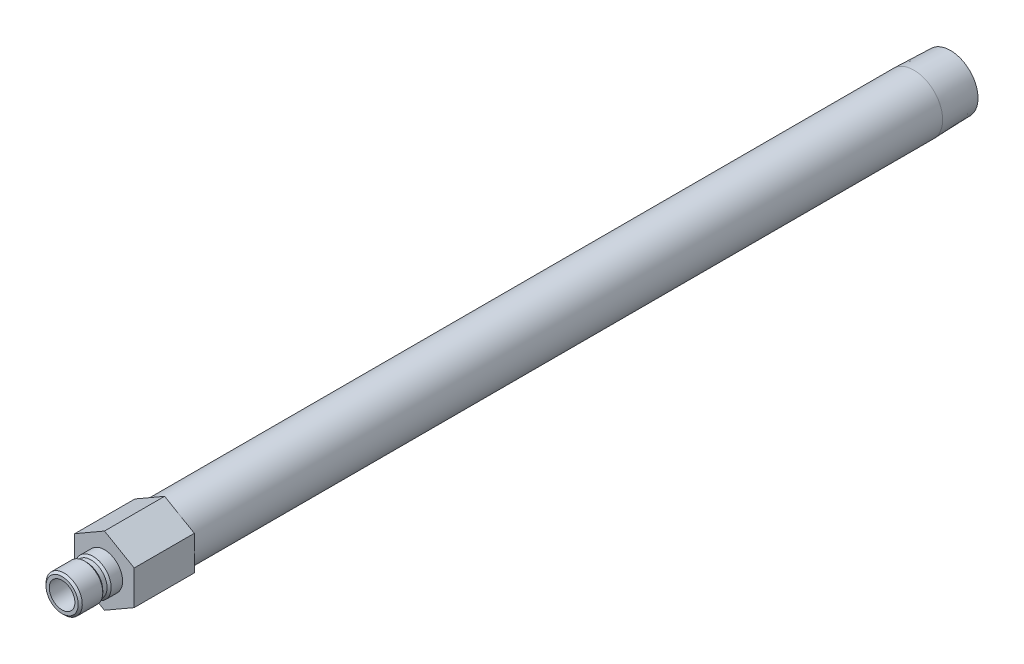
ISO-10303-21;
HEADER;
FILE_DESCRIPTION(('STEP AP214'),'2;1');
FILE_NAME('part.step','',(''),(''),'','','');
FILE_SCHEMA(('AUTOMOTIVE_DESIGN { 1 0 10303 214 1 1 1 1 }'));
ENDSEC;
DATA;
#1=APPLICATION_CONTEXT('core data for automotive mechanical design processes');
#2=APPLICATION_PROTOCOL_DEFINITION('international standard','automotive_design',2000,#1);
#3=PRODUCT_CONTEXT('',#1,'mechanical');
#4=PRODUCT('Part','Part','',(#3));
#5=PRODUCT_RELATED_PRODUCT_CATEGORY('part','',(#4));
#6=PRODUCT_DEFINITION_FORMATION('','',#4);
#7=PRODUCT_DEFINITION_CONTEXT('part definition',#1,'design');
#8=PRODUCT_DEFINITION('design','',#6,#7);
#9=PRODUCT_DEFINITION_SHAPE('','',#8);
#10=(LENGTH_UNIT() NAMED_UNIT(*) SI_UNIT(.MILLI.,.METRE.));
#11=(NAMED_UNIT(*) PLANE_ANGLE_UNIT() SI_UNIT($,.RADIAN.));
#12=(NAMED_UNIT(*) SI_UNIT($,.STERADIAN.) SOLID_ANGLE_UNIT());
#13=UNCERTAINTY_MEASURE_WITH_UNIT(LENGTH_MEASURE(1.E-05),#10,'distance_accuracy_value','');
#14=(GEOMETRIC_REPRESENTATION_CONTEXT(3) GLOBAL_UNCERTAINTY_ASSIGNED_CONTEXT((#13)) GLOBAL_UNIT_ASSIGNED_CONTEXT((#10,
#11,#12)) REPRESENTATION_CONTEXT('',''));
#15=CARTESIAN_POINT('',(0.,0.,0.));
#16=DIRECTION('',(0.,0.,1.));
#17=DIRECTION('',(1.,0.,0.));
#18=AXIS2_PLACEMENT_3D('',#15,#16,#17);
#19=CARTESIAN_POINT('',(0.,0.,0.));
#20=DIRECTION('',(0.,0.,-1.));
#21=DIRECTION('',(0.,1.,0.));
#22=AXIS2_PLACEMENT_3D('',#19,#20,#21);
#23=CYLINDRICAL_SURFACE('',#22,10.668);
#24=CARTESIAN_POINT('',(0.,0.,-300.8884));
#25=DIRECTION('',(0.,0.,-1.));
#26=DIRECTION('',(0.,1.,0.));
#27=AXIS2_PLACEMENT_3D('',#24,#25,#26);
#28=CIRCLE('',#27,10.6679999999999);
#29=CARTESIAN_POINT('',(0.,10.668,-300.8884));
#30=VERTEX_POINT('',#29);
#31=EDGE_CURVE('E168',#30,#30,#28,.T.);
#32=ORIENTED_EDGE('',*,*,#31,.F.);
#33=EDGE_LOOP('',(#32));
#34=FACE_BOUND('',#33,.T.);
#35=CARTESIAN_POINT('',(0.,0.,-22.352));
#36=DIRECTION('',(0.,0.,1.));
#37=DIRECTION('',(1.,0.,0.));
#38=AXIS2_PLACEMENT_3D('',#35,#36,#37);
#39=CIRCLE('',#38,10.668);
#40=CARTESIAN_POINT('',(10.668,0.,-22.352));
#41=VERTEX_POINT('',#40);
#42=EDGE_CURVE('E37',#41,#41,#39,.F.);
#43=ORIENTED_EDGE('',*,*,#42,.T.);
#44=EDGE_LOOP('',(#43));
#45=FACE_BOUND('',#44,.T.);
#46=ADVANCED_FACE('F33',(#34,#45),#23,.T.);
#47=CARTESIAN_POINT('',(0.,0.,0.));
#48=DIRECTION('',(0.,0.,-1.));
#49=DIRECTION('',(0.,1.,0.));
#50=AXIS2_PLACEMENT_3D('',#47,#48,#49);
#51=CYLINDRICAL_SURFACE('',#50,4.76249999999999);
#52=CARTESIAN_POINT('',(0.,0.,15.748));
#53=DIRECTION('',(0.,0.,-1.));
#54=DIRECTION('',(0.,1.,0.));
#55=AXIS2_PLACEMENT_3D('',#52,#53,#54);
#56=CIRCLE('',#55,4.7625);
#57=CARTESIAN_POINT('',(0.,4.7625,15.748));
#58=VERTEX_POINT('',#57);
#59=EDGE_CURVE('E144',#58,#58,#56,.T.);
#60=ORIENTED_EDGE('',*,*,#59,.F.);
#61=EDGE_LOOP('',(#60));
#62=FACE_BOUND('',#61,.T.);
#63=CARTESIAN_POINT('',(0.,0.,-22.352));
#64=DIRECTION('',(0.,0.,-1.));
#65=DIRECTION('',(0.,1.,0.));
#66=AXIS2_PLACEMENT_3D('',#63,#64,#65);
#67=CIRCLE('',#66,4.76249999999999);
#68=CARTESIAN_POINT('',(0.,4.7625,-22.352));
#69=VERTEX_POINT('',#68);
#70=EDGE_CURVE('E11',#69,#69,#67,.T.);
#71=ORIENTED_EDGE('',*,*,#70,.T.);
#72=EDGE_LOOP('',(#71));
#73=FACE_BOUND('',#72,.T.);
#74=ADVANCED_FACE('F35',(#62,#73),#51,.F.);
#75=CARTESIAN_POINT('',(0.,4.7625,-22.352));
#76=DIRECTION('',(0.,0.,-1.));
#77=DIRECTION('',(0.,1.,0.));
#78=AXIS2_PLACEMENT_3D('',#75,#76,#77);
#79=PLANE('',#78);
#80=CARTESIAN_POINT('',(0.,0.,-22.352));
#81=DIRECTION('',(0.,0.,-1.));
#82=DIRECTION('',(0.,1.,0.));
#83=AXIS2_PLACEMENT_3D('',#80,#81,#82);
#84=CIRCLE('',#83,7.89939999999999);
#85=CARTESIAN_POINT('',(0.,7.8994,-22.352));
#86=VERTEX_POINT('',#85);
#87=EDGE_CURVE('E43',#86,#86,#84,.T.);
#88=ORIENTED_EDGE('',*,*,#87,.T.);
#89=EDGE_LOOP('',(#88));
#90=FACE_BOUND('',#89,.T.);
#91=ORIENTED_EDGE('',*,*,#70,.F.);
#92=EDGE_LOOP('',(#91));
#93=FACE_BOUND('',#92,.T.);
#94=ADVANCED_FACE('F180',(#90,#93),#79,.T.);
#95=CARTESIAN_POINT('',(0.,0.,0.));
#96=DIRECTION('',(0.,0.,-1.));
#97=DIRECTION('',(0.,1.,0.));
#98=AXIS2_PLACEMENT_3D('',#95,#96,#97);
#99=CYLINDRICAL_SURFACE('',#98,7.89939999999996);
#100=CARTESIAN_POINT('',(0.,0.,-314.452));
#101=DIRECTION('',(0.,0.,-1.));
#102=DIRECTION('',(0.,1.,0.));
#103=AXIS2_PLACEMENT_3D('',#100,#101,#102);
#104=CIRCLE('',#103,7.89939999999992);
#105=CARTESIAN_POINT('',(0.,7.8994,-314.452));
#106=VERTEX_POINT('',#105);
#107=EDGE_CURVE('E174',#106,#106,#104,.T.);
#108=ORIENTED_EDGE('',*,*,#107,.T.);
#109=EDGE_LOOP('',(#108));
#110=FACE_BOUND('',#109,.T.);
#111=ORIENTED_EDGE('',*,*,#87,.F.);
#112=EDGE_LOOP('',(#111));
#113=FACE_BOUND('',#112,.T.);
#114=ADVANCED_FACE('F183',(#110,#113),#99,.F.);
#115=CARTESIAN_POINT('',(0.,10.244140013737,-314.452));
#116=DIRECTION('',(0.,0.,-1.));
#117=DIRECTION('',(0.,1.,0.));
#118=AXIS2_PLACEMENT_3D('',#115,#116,#117);
#119=PLANE('',#118);
#120=CARTESIAN_POINT('',(0.,0.,-314.452));
#121=DIRECTION('',(0.,0.,-1.));
#122=DIRECTION('',(0.,1.,0.));
#123=AXIS2_PLACEMENT_3D('',#120,#121,#122);
#124=CIRCLE('',#123,10.2441400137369);
#125=CARTESIAN_POINT('',(0.,10.244140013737,-314.452));
#126=VERTEX_POINT('',#125);
#127=EDGE_CURVE('E171',#126,#126,#124,.T.);
#128=ORIENTED_EDGE('',*,*,#127,.T.);
#129=EDGE_LOOP('',(#128));
#130=FACE_BOUND('',#129,.T.);
#131=ORIENTED_EDGE('',*,*,#107,.F.);
#132=EDGE_LOOP('',(#131));
#133=FACE_BOUND('',#132,.T.);
#134=ADVANCED_FACE('F185',(#130,#133),#119,.T.);
#135=CARTESIAN_POINT('',(0.,0.,-314.452));
#136=DIRECTION('',(0.,0.,1.));
#137=DIRECTION('',(0.,-1.,0.));
#138=AXIS2_PLACEMENT_3D('',#135,#136,#137);
#139=CONICAL_SURFACE('',#138,10.2441400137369,0.0312396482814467);
#140=ORIENTED_EDGE('',*,*,#31,.T.);
#141=EDGE_LOOP('',(#140));
#142=FACE_BOUND('',#141,.T.);
#143=ORIENTED_EDGE('',*,*,#127,.F.);
#144=EDGE_LOOP('',(#143));
#145=FACE_BOUND('',#144,.T.);
#146=ADVANCED_FACE('F192',(#142,#145),#139,.T.);
#147=CARTESIAN_POINT('',(0.,6.7437,0.));
#148=DIRECTION('',(0.,0.,1.));
#149=DIRECTION('',(0.,-1.,0.));
#150=AXIS2_PLACEMENT_3D('',#147,#148,#149);
#151=PLANE('',#150);
#152=CARTESIAN_POINT('',(0.,0.,0.));
#153=DIRECTION('',(0.,0.,-1.));
#154=DIRECTION('',(0.,1.,0.));
#155=AXIS2_PLACEMENT_3D('',#152,#153,#154);
#156=CIRCLE('',#155,6.7437);
#157=CARTESIAN_POINT('',(0.,6.7437,0.));
#158=VERTEX_POINT('',#157);
#159=EDGE_CURVE('E165',#158,#158,#156,.T.);
#160=ORIENTED_EDGE('',*,*,#159,.T.);
#161=EDGE_LOOP('',(#160));
#162=FACE_BOUND('',#161,.T.);
#163=DIRECTION('',(-0.866025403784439,-0.5,0.));
#164=VECTOR('',#163,1.);
#165=CARTESIAN_POINT('',(0.,12.7582862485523,0.));
#166=LINE('',#165,#164);
#167=CARTESIAN_POINT('',(0.,12.7582862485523,0.));
#168=VERTEX_POINT('',#167);
#169=CARTESIAN_POINT('',(-11.049,6.37914312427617,0.));
#170=VERTEX_POINT('',#169);
#171=EDGE_CURVE('E122',#168,#170,#166,.T.);
#172=ORIENTED_EDGE('',*,*,#171,.T.);
#173=DIRECTION('',(0.,-1.,0.));
#174=VECTOR('',#173,1.);
#175=CARTESIAN_POINT('',(-11.049,6.37914312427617,0.));
#176=LINE('',#175,#174);
#177=CARTESIAN_POINT('',(-11.049,-6.37914312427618,0.));
#178=VERTEX_POINT('',#177);
#179=EDGE_CURVE('E125',#170,#178,#176,.T.);
#180=ORIENTED_EDGE('',*,*,#179,.T.);
#181=DIRECTION('',(0.866025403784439,-0.5,0.));
#182=VECTOR('',#181,1.);
#183=CARTESIAN_POINT('',(-11.049,-6.37914312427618,0.));
#184=LINE('',#183,#182);
#185=CARTESIAN_POINT('',(0.,-12.7582862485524,0.));
#186=VERTEX_POINT('',#185);
#187=EDGE_CURVE('E128',#178,#186,#184,.T.);
#188=ORIENTED_EDGE('',*,*,#187,.T.);
#189=DIRECTION('',(0.866025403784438,0.5,0.));
#190=VECTOR('',#189,1.);
#191=CARTESIAN_POINT('',(0.,-12.7582862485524,0.));
#192=LINE('',#191,#190);
#193=CARTESIAN_POINT('',(11.049,-6.37914312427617,0.));
#194=VERTEX_POINT('',#193);
#195=EDGE_CURVE('E131',#186,#194,#192,.T.);
#196=ORIENTED_EDGE('',*,*,#195,.T.);
#197=DIRECTION('',(0.,1.,0.));
#198=VECTOR('',#197,1.);
#199=CARTESIAN_POINT('',(11.049,-6.37914312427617,0.));
#200=LINE('',#199,#198);
#201=CARTESIAN_POINT('',(11.049,6.37914312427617,0.));
#202=VERTEX_POINT('',#201);
#203=EDGE_CURVE('E99',#194,#202,#200,.T.);
#204=ORIENTED_EDGE('',*,*,#203,.T.);
#205=DIRECTION('',(-0.866025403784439,0.5,0.));
#206=VECTOR('',#205,1.);
#207=CARTESIAN_POINT('',(11.049,6.37914312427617,0.));
#208=LINE('',#207,#206);
#209=EDGE_CURVE('E134',#202,#168,#208,.T.);
#210=ORIENTED_EDGE('',*,*,#209,.T.);
#211=EDGE_LOOP('',(#172,#180,#188,#196,#204,#210));
#212=FACE_BOUND('',#211,.T.);
#213=ADVANCED_FACE('F206',(#162,#212),#151,.T.);
#214=CARTESIAN_POINT('',(0.,0.,0.));
#215=DIRECTION('',(0.,0.,-1.));
#216=DIRECTION('',(0.,1.,0.));
#217=AXIS2_PLACEMENT_3D('',#214,#215,#216);
#218=CYLINDRICAL_SURFACE('',#217,6.7437);
#219=CARTESIAN_POINT('',(0.,0.,4.25449999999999));
#220=DIRECTION('',(0.,0.,-1.));
#221=DIRECTION('',(0.,1.,0.));
#222=AXIS2_PLACEMENT_3D('',#219,#220,#221);
#223=CIRCLE('',#222,6.7437);
#224=CARTESIAN_POINT('',(0.,6.7437,4.25449999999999));
#225=VERTEX_POINT('',#224);
#226=EDGE_CURVE('E162',#225,#225,#223,.T.);
#227=ORIENTED_EDGE('',*,*,#226,.T.);
#228=EDGE_LOOP('',(#227));
#229=FACE_BOUND('',#228,.T.);
#230=ORIENTED_EDGE('',*,*,#159,.F.);
#231=EDGE_LOOP('',(#230));
#232=FACE_BOUND('',#231,.T.);
#233=ADVANCED_FACE('F213',(#229,#232),#218,.T.);
#234=CARTESIAN_POINT('',(0.,0.,4.25449999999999));
#235=DIRECTION('',(0.,0.,-1.));
#236=DIRECTION('',(0.,1.,0.));
#237=AXIS2_PLACEMENT_3D('',#234,#235,#236);
#238=CONICAL_SURFACE('',#237,6.7437,0.785398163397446);
#239=CARTESIAN_POINT('',(0.,0.,5.0165));
#240=DIRECTION('',(0.,0.,-1.));
#241=DIRECTION('',(0.,1.,0.));
#242=AXIS2_PLACEMENT_3D('',#239,#240,#241);
#243=CIRCLE('',#242,5.9817);
#244=CARTESIAN_POINT('',(0.,5.9817,5.0165));
#245=VERTEX_POINT('',#244);
#246=EDGE_CURVE('E159',#245,#245,#243,.T.);
#247=ORIENTED_EDGE('',*,*,#246,.T.);
#248=EDGE_LOOP('',(#247));
#249=FACE_BOUND('',#248,.T.);
#250=ORIENTED_EDGE('',*,*,#226,.F.);
#251=EDGE_LOOP('',(#250));
#252=FACE_BOUND('',#251,.T.);
#253=ADVANCED_FACE('F222',(#249,#252),#238,.T.);
#254=CARTESIAN_POINT('',(0.,0.,0.));
#255=DIRECTION('',(0.,0.,-1.));
#256=DIRECTION('',(0.,1.,0.));
#257=AXIS2_PLACEMENT_3D('',#254,#255,#256);
#258=CYLINDRICAL_SURFACE('',#257,5.9817);
#259=CARTESIAN_POINT('',(0.,0.,6.604));
#260=DIRECTION('',(0.,0.,-1.));
#261=DIRECTION('',(0.,1.,0.));
#262=AXIS2_PLACEMENT_3D('',#259,#260,#261);
#263=CIRCLE('',#262,5.9817);
#264=CARTESIAN_POINT('',(0.,5.9817,6.604));
#265=VERTEX_POINT('',#264);
#266=EDGE_CURVE('E156',#265,#265,#263,.T.);
#267=ORIENTED_EDGE('',*,*,#266,.T.);
#268=EDGE_LOOP('',(#267));
#269=FACE_BOUND('',#268,.T.);
#270=ORIENTED_EDGE('',*,*,#246,.F.);
#271=EDGE_LOOP('',(#270));
#272=FACE_BOUND('',#271,.T.);
#273=ADVANCED_FACE('F263',(#269,#272),#258,.T.);
#274=CARTESIAN_POINT('',(0.,0.,6.604));
#275=DIRECTION('',(0.,0.,1.));
#276=DIRECTION('',(0.,-1.,0.));
#277=AXIS2_PLACEMENT_3D('',#274,#275,#276);
#278=CONICAL_SURFACE('',#277,5.9817,0.785398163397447);
#279=CARTESIAN_POINT('',(0.,0.,7.366));
#280=DIRECTION('',(0.,0.,-1.));
#281=DIRECTION('',(0.,1.,0.));
#282=AXIS2_PLACEMENT_3D('',#279,#280,#281);
#283=CIRCLE('',#282,6.7437);
#284=CARTESIAN_POINT('',(0.,6.7437,7.366));
#285=VERTEX_POINT('',#284);
#286=EDGE_CURVE('E153',#285,#285,#283,.T.);
#287=ORIENTED_EDGE('',*,*,#286,.T.);
#288=EDGE_LOOP('',(#287));
#289=FACE_BOUND('',#288,.T.);
#290=ORIENTED_EDGE('',*,*,#266,.F.);
#291=EDGE_LOOP('',(#290));
#292=FACE_BOUND('',#291,.T.);
#293=ADVANCED_FACE('F259',(#289,#292),#278,.T.);
#294=CARTESIAN_POINT('',(0.,0.,0.));
#295=DIRECTION('',(0.,0.,-1.));
#296=DIRECTION('',(0.,1.,0.));
#297=AXIS2_PLACEMENT_3D('',#294,#295,#296);
#298=CYLINDRICAL_SURFACE('',#297,6.7437);
#299=CARTESIAN_POINT('',(0.,0.,14.986));
#300=DIRECTION('',(0.,0.,-1.));
#301=DIRECTION('',(0.,1.,0.));
#302=AXIS2_PLACEMENT_3D('',#299,#300,#301);
#303=CIRCLE('',#302,6.7437);
#304=CARTESIAN_POINT('',(0.,6.7437,14.986));
#305=VERTEX_POINT('',#304);
#306=EDGE_CURVE('E150',#305,#305,#303,.T.);
#307=ORIENTED_EDGE('',*,*,#306,.T.);
#308=EDGE_LOOP('',(#307));
#309=FACE_BOUND('',#308,.T.);
#310=ORIENTED_EDGE('',*,*,#286,.F.);
#311=EDGE_LOOP('',(#310));
#312=FACE_BOUND('',#311,.T.);
#313=ADVANCED_FACE('F255',(#309,#312),#298,.T.);
#314=CARTESIAN_POINT('',(0.,0.,14.986));
#315=DIRECTION('',(0.,0.,-1.));
#316=DIRECTION('',(0.,1.,0.));
#317=AXIS2_PLACEMENT_3D('',#314,#315,#316);
#318=CONICAL_SURFACE('',#317,6.7437,0.785398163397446);
#319=CARTESIAN_POINT('',(0.,0.,15.748));
#320=DIRECTION('',(0.,0.,-1.));
#321=DIRECTION('',(0.,1.,0.));
#322=AXIS2_PLACEMENT_3D('',#319,#320,#321);
#323=CIRCLE('',#322,5.9817);
#324=CARTESIAN_POINT('',(0.,5.9817,15.748));
#325=VERTEX_POINT('',#324);
#326=EDGE_CURVE('E147',#325,#325,#323,.T.);
#327=ORIENTED_EDGE('',*,*,#326,.T.);
#328=EDGE_LOOP('',(#327));
#329=FACE_BOUND('',#328,.T.);
#330=ORIENTED_EDGE('',*,*,#306,.F.);
#331=EDGE_LOOP('',(#330));
#332=FACE_BOUND('',#331,.T.);
#333=ADVANCED_FACE('F251',(#329,#332),#318,.T.);
#334=CARTESIAN_POINT('',(0.,4.7625,15.748));
#335=DIRECTION('',(0.,0.,1.));
#336=DIRECTION('',(0.,-1.,0.));
#337=AXIS2_PLACEMENT_3D('',#334,#335,#336);
#338=PLANE('',#337);
#339=ORIENTED_EDGE('',*,*,#59,.T.);
#340=EDGE_LOOP('',(#339));
#341=FACE_BOUND('',#340,.T.);
#342=ORIENTED_EDGE('',*,*,#326,.F.);
#343=EDGE_LOOP('',(#342));
#344=FACE_BOUND('',#343,.T.);
#345=ADVANCED_FACE('F239',(#341,#344),#338,.T.);
#346=CARTESIAN_POINT('',(0.,12.7582862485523,-22.352));
#347=DIRECTION('',(-0.5,0.866025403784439,0.));
#348=DIRECTION('',(-0.866025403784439,-0.5,0.));
#349=AXIS2_PLACEMENT_3D('',#346,#347,#348);
#350=PLANE('',#349);
#351=ORIENTED_EDGE('',*,*,#171,.F.);
#352=DIRECTION('',(0.,0.,1.));
#353=VECTOR('',#352,1.);
#354=CARTESIAN_POINT('',(0.,12.7582862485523,-22.352));
#355=LINE('',#354,#353);
#356=CARTESIAN_POINT('',(0.,12.7582862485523,-22.352));
#357=VERTEX_POINT('',#356);
#358=EDGE_CURVE('E51',#357,#168,#355,.T.);
#359=ORIENTED_EDGE('',*,*,#358,.F.);
#360=DIRECTION('',(-0.866025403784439,-0.5,0.));
#361=VECTOR('',#360,1.);
#362=CARTESIAN_POINT('',(0.,12.7582862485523,-22.352));
#363=LINE('',#362,#361);
#364=CARTESIAN_POINT('',(-11.049,6.37914312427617,-22.352));
#365=VERTEX_POINT('',#364);
#366=EDGE_CURVE('E137',#357,#365,#363,.T.);
#367=ORIENTED_EDGE('',*,*,#366,.T.);
#368=DIRECTION('',(0.,0.,1.));
#369=VECTOR('',#368,1.);
#370=CARTESIAN_POINT('',(-11.049,6.37914312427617,-22.352));
#371=LINE('',#370,#369);
#372=EDGE_CURVE('E86',#365,#170,#371,.T.);
#373=ORIENTED_EDGE('',*,*,#372,.T.);
#374=EDGE_LOOP('',(#351,#359,#367,#373));
#375=FACE_BOUND('',#374,.T.);
#376=ADVANCED_FACE('F226',(#375),#350,.T.);
#377=CARTESIAN_POINT('',(11.049,6.37914312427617,-22.352));
#378=DIRECTION('',(0.5,0.866025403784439,0.));
#379=DIRECTION('',(-0.866025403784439,0.5,0.));
#380=AXIS2_PLACEMENT_3D('',#377,#378,#379);
#381=PLANE('',#380);
#382=ORIENTED_EDGE('',*,*,#209,.F.);
#383=DIRECTION('',(0.,0.,1.));
#384=VECTOR('',#383,1.);
#385=CARTESIAN_POINT('',(11.049,6.37914312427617,-22.352));
#386=LINE('',#385,#384);
#387=CARTESIAN_POINT('',(11.049,6.37914312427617,-22.352));
#388=VERTEX_POINT('',#387);
#389=EDGE_CURVE('E74',#388,#202,#386,.T.);
#390=ORIENTED_EDGE('',*,*,#389,.F.);
#391=DIRECTION('',(-0.866025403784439,0.5,0.));
#392=VECTOR('',#391,1.);
#393=CARTESIAN_POINT('',(11.049,6.37914312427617,-22.352));
#394=LINE('',#393,#392);
#395=EDGE_CURVE('E112',#388,#357,#394,.T.);
#396=ORIENTED_EDGE('',*,*,#395,.T.);
#397=ORIENTED_EDGE('',*,*,#358,.T.);
#398=EDGE_LOOP('',(#382,#390,#396,#397));
#399=FACE_BOUND('',#398,.T.);
#400=ADVANCED_FACE('F231',(#399),#381,.T.);
#401=CARTESIAN_POINT('',(11.049,-6.37914312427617,-22.352));
#402=DIRECTION('',(1.,0.,0.));
#403=DIRECTION('',(0.,0.,-1.));
#404=AXIS2_PLACEMENT_3D('',#401,#402,#403);
#405=PLANE('',#404);
#406=ORIENTED_EDGE('',*,*,#203,.F.);
#407=DIRECTION('',(0.,0.,1.));
#408=VECTOR('',#407,1.);
#409=CARTESIAN_POINT('',(11.049,-6.37914312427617,-22.352));
#410=LINE('',#409,#408);
#411=CARTESIAN_POINT('',(11.049,-6.37914312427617,-22.352));
#412=VERTEX_POINT('',#411);
#413=EDGE_CURVE('E94',#412,#194,#410,.T.);
#414=ORIENTED_EDGE('',*,*,#413,.F.);
#415=DIRECTION('',(0.,1.,0.));
#416=VECTOR('',#415,1.);
#417=CARTESIAN_POINT('',(11.049,-6.37914312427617,-22.352));
#418=LINE('',#417,#416);
#419=EDGE_CURVE('E97',#412,#388,#418,.T.);
#420=ORIENTED_EDGE('',*,*,#419,.T.);
#421=ORIENTED_EDGE('',*,*,#389,.T.);
#422=EDGE_LOOP('',(#406,#414,#420,#421));
#423=FACE_BOUND('',#422,.T.);
#424=ADVANCED_FACE('F96',(#423),#405,.T.);
#425=CARTESIAN_POINT('',(0.,-12.7582862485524,-22.352));
#426=DIRECTION('',(0.5,-0.866025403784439,0.));
#427=DIRECTION('',(0.866025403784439,0.5,0.));
#428=AXIS2_PLACEMENT_3D('',#425,#426,#427);
#429=PLANE('',#428);
#430=ORIENTED_EDGE('',*,*,#195,.F.);
#431=DIRECTION('',(0.,0.,1.));
#432=VECTOR('',#431,1.);
#433=CARTESIAN_POINT('',(0.,-12.7582862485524,-22.352));
#434=LINE('',#433,#432);
#435=CARTESIAN_POINT('',(0.,-12.7582862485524,-22.352));
#436=VERTEX_POINT('',#435);
#437=EDGE_CURVE('E104',#436,#186,#434,.T.);
#438=ORIENTED_EDGE('',*,*,#437,.F.);
#439=DIRECTION('',(0.866025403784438,0.5,0.));
#440=VECTOR('',#439,1.);
#441=CARTESIAN_POINT('',(0.,-12.7582862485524,-22.352));
#442=LINE('',#441,#440);
#443=EDGE_CURVE('E110',#436,#412,#442,.T.);
#444=ORIENTED_EDGE('',*,*,#443,.T.);
#445=ORIENTED_EDGE('',*,*,#413,.T.);
#446=EDGE_LOOP('',(#430,#438,#444,#445));
#447=FACE_BOUND('',#446,.T.);
#448=ADVANCED_FACE('F114',(#447),#429,.T.);
#449=CARTESIAN_POINT('',(-11.049,-6.37914312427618,-22.352));
#450=DIRECTION('',(-0.5,-0.866025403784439,0.));
#451=DIRECTION('',(0.866025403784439,-0.5,0.));
#452=AXIS2_PLACEMENT_3D('',#449,#450,#451);
#453=PLANE('',#452);
#454=ORIENTED_EDGE('',*,*,#187,.F.);
#455=DIRECTION('',(0.,0.,1.));
#456=VECTOR('',#455,1.);
#457=CARTESIAN_POINT('',(-11.049,-6.37914312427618,-22.352));
#458=LINE('',#457,#456);
#459=CARTESIAN_POINT('',(-11.049,-6.37914312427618,-22.352));
#460=VERTEX_POINT('',#459);
#461=EDGE_CURVE('E141',#460,#178,#458,.T.);
#462=ORIENTED_EDGE('',*,*,#461,.F.);
#463=DIRECTION('',(0.866025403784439,-0.5,0.));
#464=VECTOR('',#463,1.);
#465=CARTESIAN_POINT('',(-11.049,-6.37914312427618,-22.352));
#466=LINE('',#465,#464);
#467=EDGE_CURVE('E115',#460,#436,#466,.T.);
#468=ORIENTED_EDGE('',*,*,#467,.T.);
#469=ORIENTED_EDGE('',*,*,#437,.T.);
#470=EDGE_LOOP('',(#454,#462,#468,#469));
#471=FACE_BOUND('',#470,.T.);
#472=ADVANCED_FACE('F230',(#471),#453,.T.);
#473=CARTESIAN_POINT('',(-11.049,6.37914312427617,-22.352));
#474=DIRECTION('',(-1.,0.,0.));
#475=DIRECTION('',(0.,0.,1.));
#476=AXIS2_PLACEMENT_3D('',#473,#474,#475);
#477=PLANE('',#476);
#478=ORIENTED_EDGE('',*,*,#179,.F.);
#479=ORIENTED_EDGE('',*,*,#372,.F.);
#480=DIRECTION('',(0.,-1.,0.));
#481=VECTOR('',#480,1.);
#482=CARTESIAN_POINT('',(-11.049,6.37914312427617,-22.352));
#483=LINE('',#482,#481);
#484=EDGE_CURVE('E117',#365,#460,#483,.T.);
#485=ORIENTED_EDGE('',*,*,#484,.T.);
#486=ORIENTED_EDGE('',*,*,#461,.T.);
#487=EDGE_LOOP('',(#478,#479,#485,#486));
#488=FACE_BOUND('',#487,.T.);
#489=ADVANCED_FACE('F227',(#488),#477,.T.);
#490=CARTESIAN_POINT('',(-11.049,6.37914312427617,-22.352));
#491=DIRECTION('',(0.,0.,1.));
#492=DIRECTION('',(1.,0.,0.));
#493=AXIS2_PLACEMENT_3D('',#490,#491,#492);
#494=PLANE('',#493);
#495=ORIENTED_EDGE('',*,*,#42,.F.);
#496=EDGE_LOOP('',(#495));
#497=FACE_BOUND('',#496,.T.);
#498=ORIENTED_EDGE('',*,*,#366,.F.);
#499=ORIENTED_EDGE('',*,*,#395,.F.);
#500=ORIENTED_EDGE('',*,*,#419,.F.);
#501=ORIENTED_EDGE('',*,*,#443,.F.);
#502=ORIENTED_EDGE('',*,*,#467,.F.);
#503=ORIENTED_EDGE('',*,*,#484,.F.);
#504=EDGE_LOOP('',(#498,#499,#500,#501,#502,#503));
#505=FACE_BOUND('',#504,.T.);
#506=ADVANCED_FACE('F108',(#497,#505),#494,.F.);
#507=CLOSED_SHELL('',(#46,#74,#94,#114,#134,#146,#213,#233,#253,#273,#293,#313,#333,#345,#376,
#400,#424,#448,#472,#489,#506));
#508=MANIFOLD_SOLID_BREP('B2',#507);
#509=ADVANCED_BREP_SHAPE_REPRESENTATION('',(#18,#508),#14);
#510=SHAPE_DEFINITION_REPRESENTATION(#9,#509);
ENDSEC;
END-ISO-10303-21;
